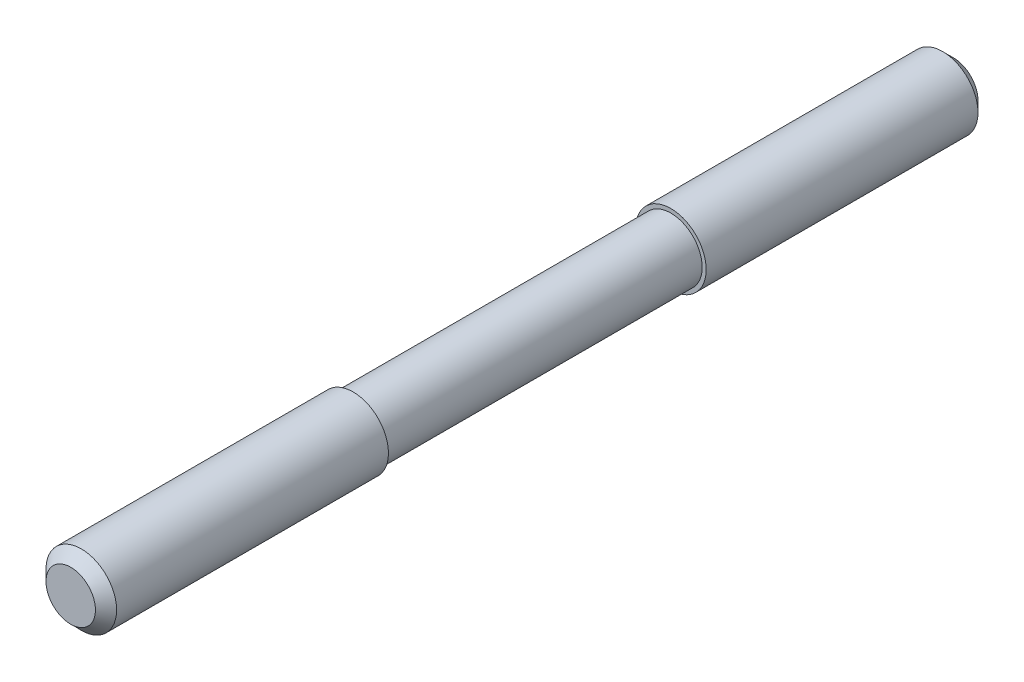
ISO-10303-21;
HEADER;
FILE_DESCRIPTION(('STEP AP214'),'2;1');
FILE_NAME('part.step','',(''),(''),'','','');
FILE_SCHEMA(('AUTOMOTIVE_DESIGN { 1 0 10303 214 1 1 1 1 }'));
ENDSEC;
DATA;
#1=APPLICATION_CONTEXT('core data for automotive mechanical design processes');
#2=APPLICATION_PROTOCOL_DEFINITION('international standard','automotive_design',2000,#1);
#3=PRODUCT_CONTEXT('',#1,'mechanical');
#4=PRODUCT('Part','Part','',(#3));
#5=PRODUCT_RELATED_PRODUCT_CATEGORY('part','',(#4));
#6=PRODUCT_DEFINITION_FORMATION('','',#4);
#7=PRODUCT_DEFINITION_CONTEXT('part definition',#1,'design');
#8=PRODUCT_DEFINITION('design','',#6,#7);
#9=PRODUCT_DEFINITION_SHAPE('','',#8);
#10=(LENGTH_UNIT() NAMED_UNIT(*) SI_UNIT(.MILLI.,.METRE.));
#11=(NAMED_UNIT(*) PLANE_ANGLE_UNIT() SI_UNIT($,.RADIAN.));
#12=(NAMED_UNIT(*) SI_UNIT($,.STERADIAN.) SOLID_ANGLE_UNIT());
#13=UNCERTAINTY_MEASURE_WITH_UNIT(LENGTH_MEASURE(1.E-05),#10,'distance_accuracy_value','');
#14=(GEOMETRIC_REPRESENTATION_CONTEXT(3) GLOBAL_UNCERTAINTY_ASSIGNED_CONTEXT((#13)) GLOBAL_UNIT_ASSIGNED_CONTEXT((#10,
#11,#12)) REPRESENTATION_CONTEXT('',''));
#15=CARTESIAN_POINT('',(0.,0.,0.));
#16=DIRECTION('',(0.,0.,1.));
#17=DIRECTION('',(1.,0.,0.));
#18=AXIS2_PLACEMENT_3D('',#15,#16,#17);
#19=CARTESIAN_POINT('',(0.,0.,0.));
#20=DIRECTION('',(0.,0.,1.));
#21=DIRECTION('',(1.,0.,0.));
#22=AXIS2_PLACEMENT_3D('',#19,#20,#21);
#23=PLANE('',#22);
#24=CARTESIAN_POINT('',(0.,0.,0.));
#25=DIRECTION('',(0.,0.,1.));
#26=DIRECTION('',(1.,0.,0.));
#27=AXIS2_PLACEMENT_3D('',#24,#25,#26);
#28=CIRCLE('',#27,2.8);
#29=CARTESIAN_POINT('',(2.8,0.,0.));
#30=VERTEX_POINT('',#29);
#31=EDGE_CURVE('E8',#30,#30,#28,.T.);
#32=ORIENTED_EDGE('',*,*,#31,.F.);
#33=EDGE_LOOP('',(#32));
#34=FACE_BOUND('',#33,.T.);
#35=ADVANCED_FACE('F12',(#34),#23,.F.);
#36=CARTESIAN_POINT('',(0.,0.,1.2));
#37=DIRECTION('',(0.,0.,1.));
#38=DIRECTION('',(1.,0.,0.));
#39=AXIS2_PLACEMENT_3D('',#36,#37,#38);
#40=CONICAL_SURFACE('',#39,4.,0.785398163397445);
#41=ORIENTED_EDGE('',*,*,#31,.T.);
#42=EDGE_LOOP('',(#41));
#43=FACE_BOUND('',#42,.T.);
#44=CARTESIAN_POINT('',(0.,0.,1.2));
#45=DIRECTION('',(0.,0.,1.));
#46=DIRECTION('',(1.,0.,0.));
#47=AXIS2_PLACEMENT_3D('',#44,#45,#46);
#48=CIRCLE('',#47,4.);
#49=CARTESIAN_POINT('',(4.,0.,1.2));
#50=VERTEX_POINT('',#49);
#51=EDGE_CURVE('E18',#50,#50,#48,.T.);
#52=ORIENTED_EDGE('',*,*,#51,.F.);
#53=EDGE_LOOP('',(#52));
#54=FACE_BOUND('',#53,.T.);
#55=ADVANCED_FACE('F62',(#43,#54),#40,.T.);
#56=CARTESIAN_POINT('',(0.,0.,70.));
#57=DIRECTION('',(0.,0.,1.));
#58=DIRECTION('',(1.,0.,0.));
#59=AXIS2_PLACEMENT_3D('',#56,#57,#58);
#60=CYLINDRICAL_SURFACE('',#59,4.);
#61=CARTESIAN_POINT('',(0.,0.,32.));
#62=DIRECTION('',(0.,0.,1.));
#63=DIRECTION('',(1.,0.,0.));
#64=AXIS2_PLACEMENT_3D('',#61,#62,#63);
#65=CIRCLE('',#64,4.);
#66=CARTESIAN_POINT('',(4.,0.,32.));
#67=VERTEX_POINT('',#66);
#68=EDGE_CURVE('E22',#67,#67,#65,.T.);
#69=ORIENTED_EDGE('',*,*,#68,.F.);
#70=EDGE_LOOP('',(#69));
#71=FACE_BOUND('',#70,.T.);
#72=ORIENTED_EDGE('',*,*,#51,.T.);
#73=EDGE_LOOP('',(#72));
#74=FACE_BOUND('',#73,.T.);
#75=ADVANCED_FACE('F68',(#71,#74),#60,.T.);
#76=CARTESIAN_POINT('',(4.,0.,32.));
#77=DIRECTION('',(0.,0.,-1.));
#78=DIRECTION('',(-1.,0.,0.));
#79=AXIS2_PLACEMENT_3D('',#76,#77,#78);
#80=PLANE('',#79);
#81=CARTESIAN_POINT('',(0.,0.,32.));
#82=DIRECTION('',(0.,0.,1.));
#83=DIRECTION('',(1.,0.,0.));
#84=AXIS2_PLACEMENT_3D('',#81,#82,#83);
#85=CIRCLE('',#84,3.55);
#86=CARTESIAN_POINT('',(3.55,0.,32.));
#87=VERTEX_POINT('',#86);
#88=EDGE_CURVE('E26',#87,#87,#85,.T.);
#89=ORIENTED_EDGE('',*,*,#88,.F.);
#90=EDGE_LOOP('',(#89));
#91=FACE_BOUND('',#90,.T.);
#92=ORIENTED_EDGE('',*,*,#68,.T.);
#93=EDGE_LOOP('',(#92));
#94=FACE_BOUND('',#93,.T.);
#95=ADVANCED_FACE('F73',(#91,#94),#80,.F.);
#96=CARTESIAN_POINT('',(0.,0.,70.));
#97=DIRECTION('',(0.,0.,1.));
#98=DIRECTION('',(1.,0.,0.));
#99=AXIS2_PLACEMENT_3D('',#96,#97,#98);
#100=CYLINDRICAL_SURFACE('',#99,3.55);
#101=CARTESIAN_POINT('',(0.,0.,68.));
#102=DIRECTION('',(0.,0.,1.));
#103=DIRECTION('',(1.,0.,0.));
#104=AXIS2_PLACEMENT_3D('',#101,#102,#103);
#105=CIRCLE('',#104,3.55);
#106=CARTESIAN_POINT('',(3.55,0.,68.));
#107=VERTEX_POINT('',#106);
#108=EDGE_CURVE('E31',#107,#107,#105,.T.);
#109=ORIENTED_EDGE('',*,*,#108,.F.);
#110=EDGE_LOOP('',(#109));
#111=FACE_BOUND('',#110,.T.);
#112=ORIENTED_EDGE('',*,*,#88,.T.);
#113=EDGE_LOOP('',(#112));
#114=FACE_BOUND('',#113,.T.);
#115=ADVANCED_FACE('F80',(#111,#114),#100,.T.);
#116=CARTESIAN_POINT('',(3.55,0.,68.));
#117=DIRECTION('',(0.,0.,1.));
#118=DIRECTION('',(1.,0.,0.));
#119=AXIS2_PLACEMENT_3D('',#116,#117,#118);
#120=PLANE('',#119);
#121=CARTESIAN_POINT('',(0.,0.,68.));
#122=DIRECTION('',(0.,0.,1.));
#123=DIRECTION('',(1.,0.,0.));
#124=AXIS2_PLACEMENT_3D('',#121,#122,#123);
#125=CIRCLE('',#124,4.);
#126=CARTESIAN_POINT('',(4.,0.,68.));
#127=VERTEX_POINT('',#126);
#128=EDGE_CURVE('E34',#127,#127,#125,.T.);
#129=ORIENTED_EDGE('',*,*,#128,.F.);
#130=EDGE_LOOP('',(#129));
#131=FACE_BOUND('',#130,.T.);
#132=ORIENTED_EDGE('',*,*,#108,.T.);
#133=EDGE_LOOP('',(#132));
#134=FACE_BOUND('',#133,.T.);
#135=ADVANCED_FACE('F58',(#131,#134),#120,.F.);
#136=CARTESIAN_POINT('',(0.,0.,70.));
#137=DIRECTION('',(0.,0.,1.));
#138=DIRECTION('',(1.,0.,0.));
#139=AXIS2_PLACEMENT_3D('',#136,#137,#138);
#140=CYLINDRICAL_SURFACE('',#139,4.);
#141=CARTESIAN_POINT('',(0.,0.,98.8));
#142=DIRECTION('',(0.,0.,1.));
#143=DIRECTION('',(1.,0.,0.));
#144=AXIS2_PLACEMENT_3D('',#141,#142,#143);
#145=CIRCLE('',#144,4.);
#146=CARTESIAN_POINT('',(4.,0.,98.8));
#147=VERTEX_POINT('',#146);
#148=EDGE_CURVE('E37',#147,#147,#145,.T.);
#149=ORIENTED_EDGE('',*,*,#148,.F.);
#150=EDGE_LOOP('',(#149));
#151=FACE_BOUND('',#150,.T.);
#152=ORIENTED_EDGE('',*,*,#128,.T.);
#153=EDGE_LOOP('',(#152));
#154=FACE_BOUND('',#153,.T.);
#155=ADVANCED_FACE('F48',(#151,#154),#140,.T.);
#156=CARTESIAN_POINT('',(0.,0.,100.));
#157=DIRECTION('',(0.,0.,-1.));
#158=DIRECTION('',(-1.,0.,0.));
#159=AXIS2_PLACEMENT_3D('',#156,#157,#158);
#160=CONICAL_SURFACE('',#159,2.8,0.78539816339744);
#161=ORIENTED_EDGE('',*,*,#148,.T.);
#162=EDGE_LOOP('',(#161));
#163=FACE_BOUND('',#162,.T.);
#164=CARTESIAN_POINT('',(0.,0.,100.));
#165=DIRECTION('',(0.,0.,1.));
#166=DIRECTION('',(1.,0.,0.));
#167=AXIS2_PLACEMENT_3D('',#164,#165,#166);
#168=CIRCLE('',#167,2.8);
#169=CARTESIAN_POINT('',(2.8,0.,100.));
#170=VERTEX_POINT('',#169);
#171=EDGE_CURVE('E40',#170,#170,#168,.T.);
#172=ORIENTED_EDGE('',*,*,#171,.F.);
#173=EDGE_LOOP('',(#172));
#174=FACE_BOUND('',#173,.T.);
#175=ADVANCED_FACE('F46',(#163,#174),#160,.T.);
#176=CARTESIAN_POINT('',(2.8,0.,100.));
#177=DIRECTION('',(0.,0.,-1.));
#178=DIRECTION('',(-1.,0.,0.));
#179=AXIS2_PLACEMENT_3D('',#176,#177,#178);
#180=PLANE('',#179);
#181=ORIENTED_EDGE('',*,*,#171,.T.);
#182=EDGE_LOOP('',(#181));
#183=FACE_BOUND('',#182,.T.);
#184=ADVANCED_FACE('F44',(#183),#180,.F.);
#185=CLOSED_SHELL('',(#35,#55,#75,#95,#115,#135,#155,#175,#184));
#186=MANIFOLD_SOLID_BREP('B1',#185);
#187=ADVANCED_BREP_SHAPE_REPRESENTATION('',(#18,#186),#14);
#188=SHAPE_DEFINITION_REPRESENTATION(#9,#187);
ENDSEC;
END-ISO-10303-21;
